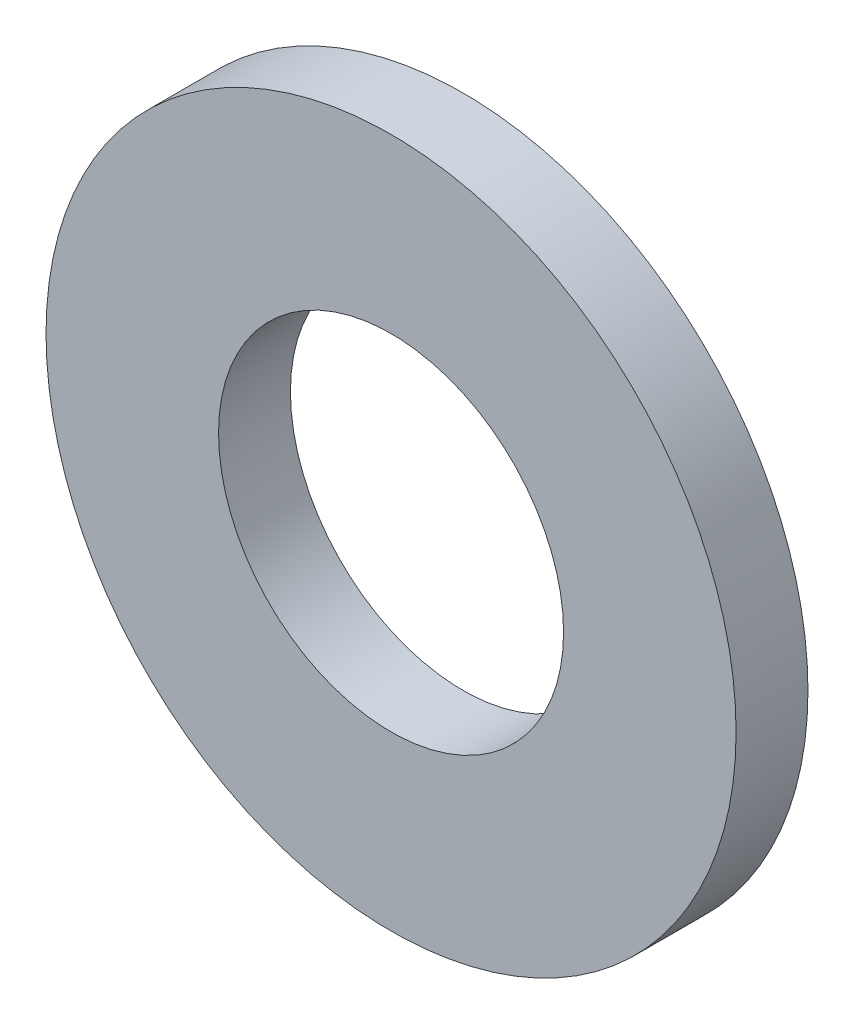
from build123d import *

# Parameters (mm, degrees)
ESQUISSE1_R          = 6
ESQUISSE1_R_2        = 3
BASE_EXTRUSION_DEPTH = 1.25


with BuildPart() as part:
    # Esquisse1 → Base-Extrusion (new body)
    with BuildSketch(Plane.XY):
        Circle(ESQUISSE1_R)
        Circle(ESQUISSE1_R_2, mode=Mode.SUBTRACT)
    extrude(amount=BASE_EXTRUSION_DEPTH)


solid = part.part
